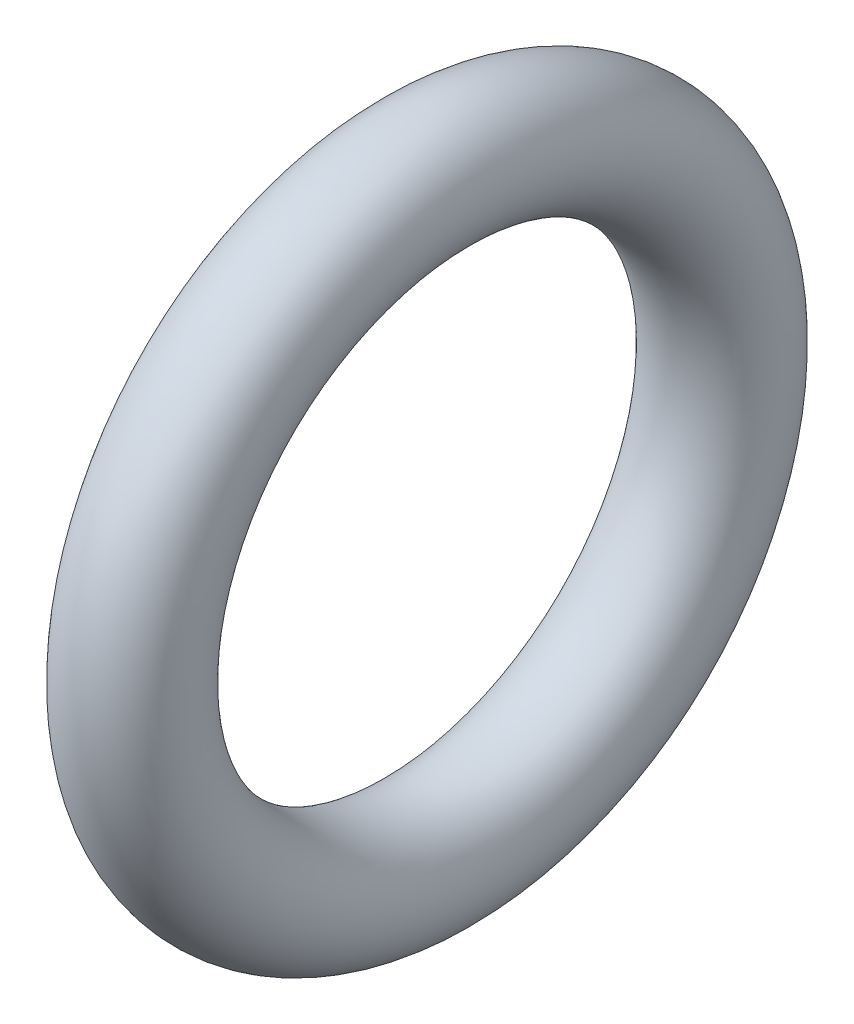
ISO-10303-21;
HEADER;
FILE_DESCRIPTION(('STEP AP214'),'2;1');
FILE_NAME('part.step','',(''),(''),'','','');
FILE_SCHEMA(('AUTOMOTIVE_DESIGN { 1 0 10303 214 1 1 1 1 }'));
ENDSEC;
DATA;
#1=APPLICATION_CONTEXT('core data for automotive mechanical design processes');
#2=APPLICATION_PROTOCOL_DEFINITION('international standard','automotive_design',2000,#1);
#3=PRODUCT_CONTEXT('',#1,'mechanical');
#4=PRODUCT('Part','Part','',(#3));
#5=PRODUCT_RELATED_PRODUCT_CATEGORY('part','',(#4));
#6=PRODUCT_DEFINITION_FORMATION('','',#4);
#7=PRODUCT_DEFINITION_CONTEXT('part definition',#1,'design');
#8=PRODUCT_DEFINITION('design','',#6,#7);
#9=PRODUCT_DEFINITION_SHAPE('','',#8);
#10=(LENGTH_UNIT() NAMED_UNIT(*) SI_UNIT(.MILLI.,.METRE.));
#11=(NAMED_UNIT(*) PLANE_ANGLE_UNIT() SI_UNIT($,.RADIAN.));
#12=(NAMED_UNIT(*) SI_UNIT($,.STERADIAN.) SOLID_ANGLE_UNIT());
#13=UNCERTAINTY_MEASURE_WITH_UNIT(LENGTH_MEASURE(1.E-05),#10,'distance_accuracy_value','');
#14=(GEOMETRIC_REPRESENTATION_CONTEXT(3) GLOBAL_UNCERTAINTY_ASSIGNED_CONTEXT((#13)) GLOBAL_UNIT_ASSIGNED_CONTEXT((#10,
#11,#12)) REPRESENTATION_CONTEXT('',''));
#15=CARTESIAN_POINT('',(0.,0.,0.));
#16=DIRECTION('',(0.,0.,1.));
#17=DIRECTION('',(1.,0.,0.));
#18=AXIS2_PLACEMENT_3D('',#15,#16,#17);
#19=CARTESIAN_POINT('',(7.5,0.,0.));
#20=DIRECTION('',(1.,0.,0.));
#21=DIRECTION('',(0.,-1.,0.));
#22=AXIS2_PLACEMENT_3D('',#19,#20,#21);
#23=TOROIDAL_SURFACE('',#22,19.25,3.95);
#24=CARTESIAN_POINT('',(7.5,-23.2,0.));
#25=VERTEX_POINT('',#24);
#26=VERTEX_LOOP('',#25);
#27=FACE_BOUND('',#26,.T.);
#28=ADVANCED_FACE('F26',(#27),#23,.T.);
#29=CLOSED_SHELL('',(#28));
#30=MANIFOLD_SOLID_BREP('B2',#29);
#31=ADVANCED_BREP_SHAPE_REPRESENTATION('',(#18,#30),#14);
#32=SHAPE_DEFINITION_REPRESENTATION(#9,#31);
ENDSEC;
END-ISO-10303-21;
